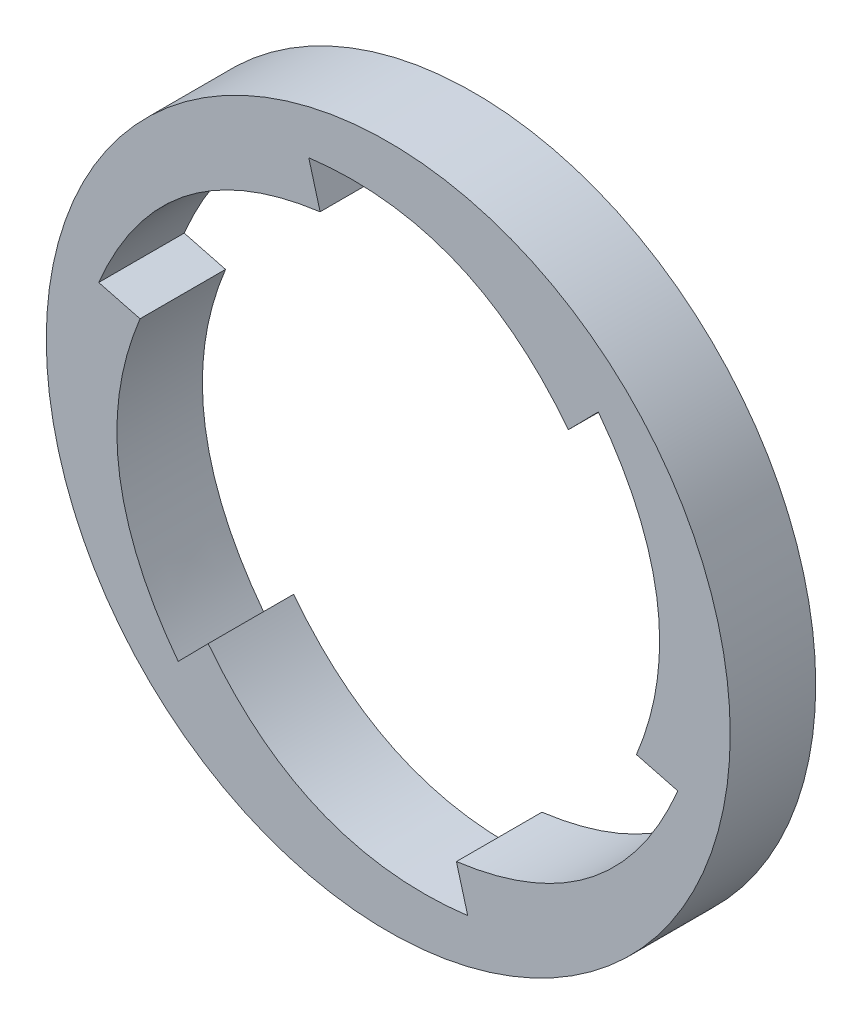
from build123d import *

# Parameters (mm, degrees)
SKETCH1_R           = 25.4
BOSS_EXTRUDE1_DEPTH = 6.35


with BuildPart() as part:
    # Sketch1 → Boss-Extrude1 (new body)
    with BuildSketch(Plane.XY):
        Circle(SKETCH1_R)
        with BuildLine():
            Line((-18.435447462, 4.799664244), (-21.504124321, 5.598593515))
            add(Edge.make_bspline(
                [(-21.504124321, 5.598593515), (-16.788909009, 16.809984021), (-5.061092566, 18.365397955)],
                knots=[0, 0, 0, 1, 1, 1], degree=2))
            Line((-5.061092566, 18.365397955), (-5.903537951, 21.422414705))
            add(Edge.make_bspline(
                [(-5.903537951, 21.422414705), (6.163418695, 22.944613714), (13.374354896, 13.56573371)],
                knots=[0, 0, 0, 1, 1, 1], degree=2))
            Line((13.374354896, 13.56573371), (15.60058637, 15.82382119))
            add(Edge.make_bspline(
                [(15.60058637, 15.82382119), (22.952327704, 6.134629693), (18.435447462, -4.799664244)],
                knots=[0, 0, 0, 1, 1, 1], degree=2))
            Line((18.435447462, -4.799664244), (21.504124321, -5.598593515))
            add(Edge.make_bspline(
                [(21.504124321, -5.598593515), (16.788909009, -16.809984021), (5.061092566, -18.365397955)],
                knots=[0, 0, 0, 1, 1, 1], degree=2))
            Line((5.061092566, -18.365397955), (5.903537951, -21.422414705))
            add(Edge.make_bspline(
                [(5.903537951, -21.422414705), (-6.163418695, -22.944613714), (-13.374354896, -13.56573371)],
                knots=[0, 0, 0, 1, 1, 1], degree=2))
            Line((-13.374354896, -13.56573371), (-15.60058637, -15.82382119))
            add(Edge.make_bspline(
                [(-15.60058637, -15.82382119), (-22.952327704, -6.134629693), (-18.435447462, 4.799664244)],
                knots=[0, 0, 0, 1, 1, 1], degree=2))
        make_face(mode=Mode.SUBTRACT)
    extrude(amount=BOSS_EXTRUDE1_DEPTH)


solid = part.part
